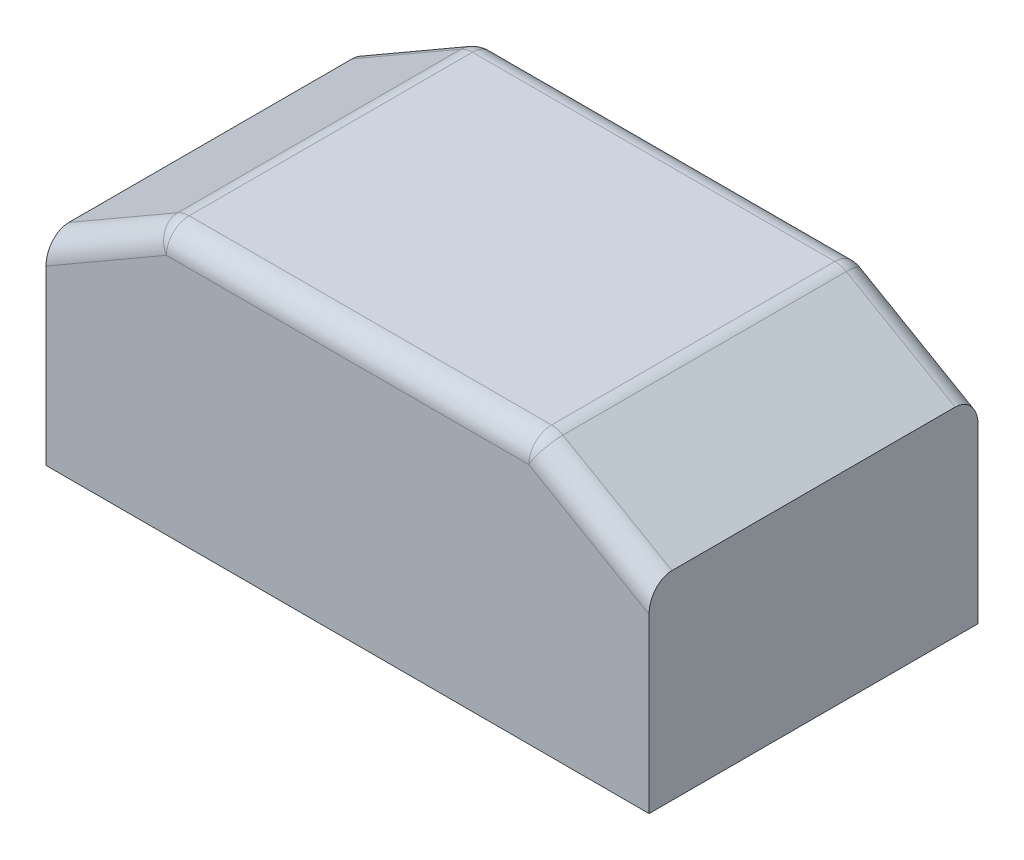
ISO-10303-21;
HEADER;
FILE_DESCRIPTION(('STEP AP214'),'2;1');
FILE_NAME('part.step','',(''),(''),'','','');
FILE_SCHEMA(('AUTOMOTIVE_DESIGN { 1 0 10303 214 1 1 1 1 }'));
ENDSEC;
DATA;
#1=APPLICATION_CONTEXT('core data for automotive mechanical design processes');
#2=APPLICATION_PROTOCOL_DEFINITION('international standard','automotive_design',2000,#1);
#3=PRODUCT_CONTEXT('',#1,'mechanical');
#4=PRODUCT('Part','Part','',(#3));
#5=PRODUCT_RELATED_PRODUCT_CATEGORY('part','',(#4));
#6=PRODUCT_DEFINITION_FORMATION('','',#4);
#7=PRODUCT_DEFINITION_CONTEXT('part definition',#1,'design');
#8=PRODUCT_DEFINITION('design','',#6,#7);
#9=PRODUCT_DEFINITION_SHAPE('','',#8);
#10=(LENGTH_UNIT() NAMED_UNIT(*) SI_UNIT(.MILLI.,.METRE.));
#11=(NAMED_UNIT(*) PLANE_ANGLE_UNIT() SI_UNIT($,.RADIAN.));
#12=(NAMED_UNIT(*) SI_UNIT($,.STERADIAN.) SOLID_ANGLE_UNIT());
#13=UNCERTAINTY_MEASURE_WITH_UNIT(LENGTH_MEASURE(1.E-05),#10,'distance_accuracy_value','');
#14=(GEOMETRIC_REPRESENTATION_CONTEXT(3) GLOBAL_UNCERTAINTY_ASSIGNED_CONTEXT((#13)) GLOBAL_UNIT_ASSIGNED_CONTEXT((#10,
#11,#12)) REPRESENTATION_CONTEXT('',''));
#15=CARTESIAN_POINT('',(0.,0.,0.));
#16=DIRECTION('',(0.,0.,1.));
#17=DIRECTION('',(1.,0.,0.));
#18=AXIS2_PLACEMENT_3D('',#15,#16,#17);
#19=CARTESIAN_POINT('',(0.,58.,0.));
#20=DIRECTION('',(1.,0.,0.));
#21=DIRECTION('',(0.,0.,-1.));
#22=AXIS2_PLACEMENT_3D('',#19,#20,#21);
#23=PLANE('',#22);
#24=DIRECTION('',(0.,0.,-1.));
#25=VECTOR('',#24,1.);
#26=CARTESIAN_POINT('',(0.,43.5662432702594,0.));
#27=LINE('',#26,#25);
#28=CARTESIAN_POINT('',(0.,43.5662432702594,-5.));
#29=VERTEX_POINT('',#28);
#30=CARTESIAN_POINT('',(0.,43.5662432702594,-67.));
#31=VERTEX_POINT('',#30);
#32=EDGE_CURVE('E129',#29,#31,#27,.T.);
#33=ORIENTED_EDGE('',*,*,#32,.T.);
#34=CARTESIAN_POINT('',(0.,37.7927405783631,-67.));
#35=DIRECTION('',(1.,0.,0.));
#36=DIRECTION('',(0.,1.,0.));
#37=AXIS2_PLACEMENT_3D('',#34,#35,#36);
#38=ELLIPSE('',#37,5.77350269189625,5.);
#39=CARTESIAN_POINT('',(0.,37.7927405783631,-72.));
#40=VERTEX_POINT('',#39);
#41=EDGE_CURVE('E184',#31,#40,#38,.F.);
#42=ORIENTED_EDGE('',*,*,#41,.T.);
#43=DIRECTION('',(0.,-1.,0.));
#44=VECTOR('',#43,1.);
#45=CARTESIAN_POINT('',(0.,58.,-72.));
#46=LINE('',#45,#44);
#47=CARTESIAN_POINT('',(0.,0.,-72.));
#48=VERTEX_POINT('',#47);
#49=EDGE_CURVE('E142',#40,#48,#46,.T.);
#50=ORIENTED_EDGE('',*,*,#49,.T.);
#51=DIRECTION('',(0.,0.,1.));
#52=VECTOR('',#51,1.);
#53=CARTESIAN_POINT('',(0.,0.,0.));
#54=LINE('',#53,#52);
#55=CARTESIAN_POINT('',(0.,0.,0.));
#56=VERTEX_POINT('',#55);
#57=EDGE_CURVE('E136',#48,#56,#54,.T.);
#58=ORIENTED_EDGE('',*,*,#57,.T.);
#59=DIRECTION('',(0.,-1.,0.));
#60=VECTOR('',#59,1.);
#61=CARTESIAN_POINT('',(0.,58.,0.));
#62=LINE('',#61,#60);
#63=CARTESIAN_POINT('',(0.,37.7927405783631,0.));
#64=VERTEX_POINT('',#63);
#65=EDGE_CURVE('E121',#64,#56,#62,.T.);
#66=ORIENTED_EDGE('',*,*,#65,.F.);
#67=CARTESIAN_POINT('',(0.,37.7927405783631,-5.));
#68=DIRECTION('',(1.,0.,0.));
#69=DIRECTION('',(0.,-1.,0.));
#70=AXIS2_PLACEMENT_3D('',#67,#68,#69);
#71=ELLIPSE('',#70,5.77350269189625,5.);
#72=EDGE_CURVE('E182',#64,#29,#71,.F.);
#73=ORIENTED_EDGE('',*,*,#72,.T.);
#74=EDGE_LOOP('',(#33,#42,#50,#58,#66,#73));
#75=FACE_BOUND('',#74,.T.);
#76=ADVANCED_FACE('F34',(#75),#23,.F.);
#77=CARTESIAN_POINT('',(0.,58.,0.));
#78=DIRECTION('',(0.,0.,-1.));
#79=DIRECTION('',(-1.,0.,0.));
#80=AXIS2_PLACEMENT_3D('',#77,#78,#79);
#81=PLANE('',#80);
#82=DIRECTION('',(0.,-1.,0.));
#83=VECTOR('',#82,1.);
#84=CARTESIAN_POINT('',(132.,58.,0.));
#85=LINE('',#84,#83);
#86=CARTESIAN_POINT('',(132.,37.7927405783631,0.));
#87=VERTEX_POINT('',#86);
#88=CARTESIAN_POINT('',(132.,0.,0.));
#89=VERTEX_POINT('',#88);
#90=EDGE_CURVE('E130',#87,#89,#85,.T.);
#91=ORIENTED_EDGE('',*,*,#90,.F.);
#92=DIRECTION('',(0.86602540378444,-0.499999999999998,0.));
#93=VECTOR('',#92,1.);
#94=CARTESIAN_POINT('',(104.5,53.6698729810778,0.));
#95=LINE('',#94,#93);
#96=CARTESIAN_POINT('',(105.660254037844,53.,0.));
#97=VERTEX_POINT('',#96);
#98=EDGE_CURVE('E11',#87,#97,#95,.F.);
#99=ORIENTED_EDGE('',*,*,#98,.T.);
#100=DIRECTION('',(1.,0.,0.));
#101=VECTOR('',#100,1.);
#102=CARTESIAN_POINT('',(0.,53.,0.));
#103=LINE('',#102,#101);
#104=CARTESIAN_POINT('',(26.3397459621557,53.,0.));
#105=VERTEX_POINT('',#104);
#106=EDGE_CURVE('E50',#97,#105,#103,.F.);
#107=ORIENTED_EDGE('',*,*,#106,.T.);
#108=DIRECTION('',(0.86602540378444,0.499999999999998,0.));
#109=VECTOR('',#108,1.);
#110=CARTESIAN_POINT('',(2.5,39.2361162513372,0.));
#111=LINE('',#110,#109);
#112=EDGE_CURVE('E43',#105,#64,#111,.F.);
#113=ORIENTED_EDGE('',*,*,#112,.T.);
#114=ORIENTED_EDGE('',*,*,#65,.T.);
#115=DIRECTION('',(1.,0.,0.));
#116=VECTOR('',#115,1.);
#117=CARTESIAN_POINT('',(0.,0.,0.));
#118=LINE('',#117,#116);
#119=EDGE_CURVE('E124',#56,#89,#118,.T.);
#120=ORIENTED_EDGE('',*,*,#119,.T.);
#121=EDGE_LOOP('',(#91,#99,#107,#113,#114,#120));
#122=FACE_BOUND('',#121,.T.);
#123=ADVANCED_FACE('F123',(#122),#81,.F.);
#124=CARTESIAN_POINT('',(132.,58.,0.));
#125=DIRECTION('',(-1.,0.,0.));
#126=DIRECTION('',(0.,0.,1.));
#127=AXIS2_PLACEMENT_3D('',#124,#125,#126);
#128=PLANE('',#127);
#129=DIRECTION('',(0.,-1.,0.));
#130=VECTOR('',#129,1.);
#131=CARTESIAN_POINT('',(132.,58.,-72.));
#132=LINE('',#131,#130);
#133=CARTESIAN_POINT('',(132.,37.7927405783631,-72.));
#134=VERTEX_POINT('',#133);
#135=CARTESIAN_POINT('',(132.,0.,-72.));
#136=VERTEX_POINT('',#135);
#137=EDGE_CURVE('E152',#134,#136,#132,.T.);
#138=ORIENTED_EDGE('',*,*,#137,.F.);
#139=CARTESIAN_POINT('',(132.,37.7927405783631,-67.));
#140=DIRECTION('',(-1.,0.,0.));
#141=DIRECTION('',(0.,-1.,0.));
#142=AXIS2_PLACEMENT_3D('',#139,#140,#141);
#143=ELLIPSE('',#142,5.77350269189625,5.);
#144=CARTESIAN_POINT('',(132.,43.5662432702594,-67.));
#145=VERTEX_POINT('',#144);
#146=EDGE_CURVE('E168',#134,#145,#143,.F.);
#147=ORIENTED_EDGE('',*,*,#146,.T.);
#148=DIRECTION('',(0.,0.,1.));
#149=VECTOR('',#148,1.);
#150=CARTESIAN_POINT('',(132.,43.5662432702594,0.));
#151=LINE('',#150,#149);
#152=CARTESIAN_POINT('',(132.,43.5662432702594,-5.));
#153=VERTEX_POINT('',#152);
#154=EDGE_CURVE('E156',#145,#153,#151,.T.);
#155=ORIENTED_EDGE('',*,*,#154,.T.);
#156=CARTESIAN_POINT('',(132.,37.7927405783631,-5.));
#157=DIRECTION('',(-1.,0.,0.));
#158=DIRECTION('',(0.,1.,0.));
#159=AXIS2_PLACEMENT_3D('',#156,#157,#158);
#160=ELLIPSE('',#159,5.77350269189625,5.);
#161=EDGE_CURVE('E166',#153,#87,#160,.F.);
#162=ORIENTED_EDGE('',*,*,#161,.T.);
#163=ORIENTED_EDGE('',*,*,#90,.T.);
#164=DIRECTION('',(0.,0.,-1.));
#165=VECTOR('',#164,1.);
#166=CARTESIAN_POINT('',(132.,0.,0.));
#167=LINE('',#166,#165);
#168=EDGE_CURVE('E138',#89,#136,#167,.T.);
#169=ORIENTED_EDGE('',*,*,#168,.T.);
#170=EDGE_LOOP('',(#138,#147,#155,#162,#163,#169));
#171=FACE_BOUND('',#170,.T.);
#172=ADVANCED_FACE('F266',(#171),#128,.F.);
#173=CARTESIAN_POINT('',(0.,58.,-72.));
#174=DIRECTION('',(0.,0.,1.));
#175=DIRECTION('',(1.,0.,0.));
#176=AXIS2_PLACEMENT_3D('',#173,#174,#175);
#177=PLANE('',#176);
#178=DIRECTION('',(-1.,0.,0.));
#179=VECTOR('',#178,1.);
#180=CARTESIAN_POINT('',(0.,53.,-72.));
#181=LINE('',#180,#179);
#182=CARTESIAN_POINT('',(26.3397459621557,53.,-72.));
#183=VERTEX_POINT('',#182);
#184=CARTESIAN_POINT('',(105.660254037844,53.,-72.));
#185=VERTEX_POINT('',#184);
#186=EDGE_CURVE('E159',#183,#185,#181,.F.);
#187=ORIENTED_EDGE('',*,*,#186,.T.);
#188=DIRECTION('',(-0.86602540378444,0.499999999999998,0.));
#189=VECTOR('',#188,1.);
#190=CARTESIAN_POINT('',(129.5,39.2361162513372,-72.));
#191=LINE('',#190,#189);
#192=EDGE_CURVE('E163',#185,#134,#191,.F.);
#193=ORIENTED_EDGE('',*,*,#192,.T.);
#194=ORIENTED_EDGE('',*,*,#137,.T.);
#195=DIRECTION('',(-1.,0.,0.));
#196=VECTOR('',#195,1.);
#197=CARTESIAN_POINT('',(0.,0.,-72.));
#198=LINE('',#197,#196);
#199=EDGE_CURVE('E149',#136,#48,#198,.T.);
#200=ORIENTED_EDGE('',*,*,#199,.T.);
#201=ORIENTED_EDGE('',*,*,#49,.F.);
#202=DIRECTION('',(-0.86602540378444,-0.499999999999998,0.));
#203=VECTOR('',#202,1.);
#204=CARTESIAN_POINT('',(27.5000000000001,53.6698729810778,-72.));
#205=LINE('',#204,#203);
#206=EDGE_CURVE('E161',#40,#183,#205,.F.);
#207=ORIENTED_EDGE('',*,*,#206,.T.);
#208=EDGE_LOOP('',(#187,#193,#194,#200,#201,#207));
#209=FACE_BOUND('',#208,.T.);
#210=ADVANCED_FACE('F262',(#209),#177,.F.);
#211=CARTESIAN_POINT('',(0.,58.,0.));
#212=DIRECTION('',(0.,-1.,0.));
#213=DIRECTION('',(0.,0.,-1.));
#214=AXIS2_PLACEMENT_3D('',#211,#212,#213);
#215=PLANE('',#214);
#216=DIRECTION('',(1.,0.,0.));
#217=VECTOR('',#216,1.);
#218=CARTESIAN_POINT('',(0.,58.,-5.));
#219=LINE('',#218,#217);
#220=CARTESIAN_POINT('',(26.3397459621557,58.,-5.));
#221=VERTEX_POINT('',#220);
#222=CARTESIAN_POINT('',(105.660254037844,58.,-5.));
#223=VERTEX_POINT('',#222);
#224=EDGE_CURVE('E188',#221,#223,#219,.T.);
#225=ORIENTED_EDGE('',*,*,#224,.T.);
#226=DIRECTION('',(0.,0.,1.));
#227=VECTOR('',#226,1.);
#228=CARTESIAN_POINT('',(105.660254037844,58.,-72.));
#229=LINE('',#228,#227);
#230=CARTESIAN_POINT('',(105.660254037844,58.,-67.));
#231=VERTEX_POINT('',#230);
#232=EDGE_CURVE('E193',#223,#231,#229,.F.);
#233=ORIENTED_EDGE('',*,*,#232,.T.);
#234=DIRECTION('',(-1.,0.,0.));
#235=VECTOR('',#234,1.);
#236=CARTESIAN_POINT('',(0.,58.,-67.));
#237=LINE('',#236,#235);
#238=CARTESIAN_POINT('',(26.3397459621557,58.,-67.));
#239=VERTEX_POINT('',#238);
#240=EDGE_CURVE('E190',#231,#239,#237,.T.);
#241=ORIENTED_EDGE('',*,*,#240,.T.);
#242=DIRECTION('',(0.,0.,-1.));
#243=VECTOR('',#242,1.);
#244=CARTESIAN_POINT('',(26.3397459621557,58.,0.));
#245=LINE('',#244,#243);
#246=EDGE_CURVE('E186',#239,#221,#245,.F.);
#247=ORIENTED_EDGE('',*,*,#246,.T.);
#248=EDGE_LOOP('',(#225,#233,#241,#247));
#249=FACE_BOUND('',#248,.T.);
#250=ADVANCED_FACE('F280',(#249),#215,.F.);
#251=CARTESIAN_POINT('',(0.,0.,0.));
#252=DIRECTION('',(0.,-1.,0.));
#253=DIRECTION('',(0.,0.,-1.));
#254=AXIS2_PLACEMENT_3D('',#251,#252,#253);
#255=PLANE('',#254);
#256=ORIENTED_EDGE('',*,*,#57,.F.);
#257=ORIENTED_EDGE('',*,*,#199,.F.);
#258=ORIENTED_EDGE('',*,*,#168,.F.);
#259=ORIENTED_EDGE('',*,*,#119,.F.);
#260=EDGE_LOOP('',(#256,#257,#258,#259));
#261=FACE_BOUND('',#260,.T.);
#262=ADVANCED_FACE('F134',(#261),#255,.T.);
#263=CARTESIAN_POINT('',(25.0000000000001,58.,0.));
#264=DIRECTION('',(0.499999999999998,-0.866025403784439,0.));
#265=DIRECTION('',(0.,0.,1.));
#266=AXIS2_PLACEMENT_3D('',#263,#264,#265);
#267=PLANE('',#266);
#268=DIRECTION('',(0.,0.,1.));
#269=VECTOR('',#268,1.);
#270=CARTESIAN_POINT('',(23.8397459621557,57.3301270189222,-72.));
#271=LINE('',#270,#269);
#272=CARTESIAN_POINT('',(23.8397459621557,57.3301270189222,-5.));
#273=VERTEX_POINT('',#272);
#274=CARTESIAN_POINT('',(23.8397459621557,57.3301270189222,-67.));
#275=VERTEX_POINT('',#274);
#276=EDGE_CURVE('E176',#273,#275,#271,.F.);
#277=ORIENTED_EDGE('',*,*,#276,.T.);
#278=DIRECTION('',(0.86602540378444,0.499999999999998,0.));
#279=VECTOR('',#278,1.);
#280=CARTESIAN_POINT('',(0.,43.5662432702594,-67.));
#281=LINE('',#280,#279);
#282=EDGE_CURVE('E180',#275,#31,#281,.F.);
#283=ORIENTED_EDGE('',*,*,#282,.T.);
#284=ORIENTED_EDGE('',*,*,#32,.F.);
#285=DIRECTION('',(-0.86602540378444,-0.499999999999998,0.));
#286=VECTOR('',#285,1.);
#287=CARTESIAN_POINT('',(25.0000000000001,58.,-5.));
#288=LINE('',#287,#286);
#289=EDGE_CURVE('E178',#29,#273,#288,.F.);
#290=ORIENTED_EDGE('',*,*,#289,.T.);
#291=EDGE_LOOP('',(#277,#283,#284,#290));
#292=FACE_BOUND('',#291,.T.);
#293=ADVANCED_FACE('F242',(#292),#267,.F.);
#294=CARTESIAN_POINT('',(107.,58.,0.));
#295=DIRECTION('',(-0.499999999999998,-0.86602540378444,0.));
#296=DIRECTION('',(0.,0.,-1.));
#297=AXIS2_PLACEMENT_3D('',#294,#295,#296);
#298=PLANE('',#297);
#299=ORIENTED_EDGE('',*,*,#154,.F.);
#300=DIRECTION('',(0.86602540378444,-0.499999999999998,0.));
#301=VECTOR('',#300,1.);
#302=CARTESIAN_POINT('',(107.,58.,-67.));
#303=LINE('',#302,#301);
#304=CARTESIAN_POINT('',(108.160254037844,57.3301270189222,-67.));
#305=VERTEX_POINT('',#304);
#306=EDGE_CURVE('E174',#145,#305,#303,.F.);
#307=ORIENTED_EDGE('',*,*,#306,.T.);
#308=DIRECTION('',(0.,0.,-1.));
#309=VECTOR('',#308,1.);
#310=CARTESIAN_POINT('',(108.160254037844,57.3301270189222,0.));
#311=LINE('',#310,#309);
#312=CARTESIAN_POINT('',(108.160254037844,57.3301270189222,-5.));
#313=VERTEX_POINT('',#312);
#314=EDGE_CURVE('E170',#305,#313,#311,.F.);
#315=ORIENTED_EDGE('',*,*,#314,.T.);
#316=DIRECTION('',(-0.86602540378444,0.499999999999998,0.));
#317=VECTOR('',#316,1.);
#318=CARTESIAN_POINT('',(132.,43.5662432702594,-5.));
#319=LINE('',#318,#317);
#320=EDGE_CURVE('E172',#313,#153,#319,.F.);
#321=ORIENTED_EDGE('',*,*,#320,.T.);
#322=EDGE_LOOP('',(#299,#307,#315,#321));
#323=FACE_BOUND('',#322,.T.);
#324=ADVANCED_FACE('F299',(#323),#298,.F.);
#325=CARTESIAN_POINT('',(8.74999999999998,42.8445554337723,-5.));
#326=DIRECTION('',(-0.86602540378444,-0.499999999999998,0.));
#327=DIRECTION('',(0.499999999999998,-0.866025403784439,0.));
#328=AXIS2_PLACEMENT_3D('',#325,#326,#327);
#329=CYLINDRICAL_SURFACE('',#328,5.);
#330=CARTESIAN_POINT('',(26.3397459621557,53.,-5.));
#331=DIRECTION('',(0.86602540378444,0.499999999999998,0.));
#332=DIRECTION('',(-0.499999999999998,0.86602540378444,0.));
#333=AXIS2_PLACEMENT_3D('',#330,#331,#332);
#334=CIRCLE('',#333,5.);
#335=EDGE_CURVE('E38',#273,#105,#334,.T.);
#336=ORIENTED_EDGE('',*,*,#335,.F.);
#337=ORIENTED_EDGE('',*,*,#289,.F.);
#338=ORIENTED_EDGE('',*,*,#72,.F.);
#339=ORIENTED_EDGE('',*,*,#112,.F.);
#340=EDGE_LOOP('',(#336,#337,#338,#339));
#341=FACE_BOUND('',#340,.T.);
#342=ADVANCED_FACE('F36',(#341),#329,.T.);
#343=CARTESIAN_POINT('',(26.3397459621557,53.,-5.));
#344=DIRECTION('',(0.,0.,1.));
#345=DIRECTION('',(1.,0.,0.));
#346=AXIS2_PLACEMENT_3D('',#343,#344,#345);
#347=SPHERICAL_SURFACE('',#346,5.);
#348=CARTESIAN_POINT('',(26.3397459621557,53.,-5.));
#349=DIRECTION('',(0.,0.,1.));
#350=DIRECTION('',(1.,0.,0.));
#351=AXIS2_PLACEMENT_3D('',#348,#349,#350);
#352=CIRCLE('',#351,5.);
#353=EDGE_CURVE('E223',#273,#221,#352,.F.);
#354=ORIENTED_EDGE('',*,*,#353,.F.);
#355=ORIENTED_EDGE('',*,*,#335,.T.);
#356=CARTESIAN_POINT('',(26.3397459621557,53.,-5.));
#357=DIRECTION('',(-1.,0.,0.));
#358=DIRECTION('',(0.,-1.,0.));
#359=AXIS2_PLACEMENT_3D('',#356,#357,#358);
#360=CIRCLE('',#359,5.);
#361=EDGE_CURVE('E146',#221,#105,#360,.F.);
#362=ORIENTED_EDGE('',*,*,#361,.F.);
#363=EDGE_LOOP('',(#354,#355,#362));
#364=FACE_BOUND('',#363,.T.);
#365=ADVANCED_FACE('F234',(#364),#347,.T.);
#366=CARTESIAN_POINT('',(24.2499999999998,100.002232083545,-5.));
#367=DIRECTION('',(-0.86602540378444,0.499999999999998,0.));
#368=DIRECTION('',(-0.499999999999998,-0.86602540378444,0.));
#369=AXIS2_PLACEMENT_3D('',#366,#367,#368);
#370=CYLINDRICAL_SURFACE('',#369,5.);
#371=ORIENTED_EDGE('',*,*,#161,.F.);
#372=ORIENTED_EDGE('',*,*,#320,.F.);
#373=CARTESIAN_POINT('',(105.660254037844,53.,-5.));
#374=DIRECTION('',(-0.866025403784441,0.499999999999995,0.));
#375=DIRECTION('',(-0.499999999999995,-0.866025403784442,0.));
#376=AXIS2_PLACEMENT_3D('',#373,#374,#375);
#377=CIRCLE('',#376,5.);
#378=EDGE_CURVE('E220',#97,#313,#377,.T.);
#379=ORIENTED_EDGE('',*,*,#378,.F.);
#380=ORIENTED_EDGE('',*,*,#98,.F.);
#381=EDGE_LOOP('',(#371,#372,#379,#380));
#382=FACE_BOUND('',#381,.T.);
#383=ADVANCED_FACE('F269',(#382),#370,.T.);
#384=CARTESIAN_POINT('',(0.,53.,-5.));
#385=DIRECTION('',(1.,0.,0.));
#386=DIRECTION('',(0.,0.,-1.));
#387=AXIS2_PLACEMENT_3D('',#384,#385,#386);
#388=CYLINDRICAL_SURFACE('',#387,5.);
#389=ORIENTED_EDGE('',*,*,#361,.T.);
#390=ORIENTED_EDGE('',*,*,#106,.F.);
#391=CARTESIAN_POINT('',(105.660254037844,53.,-5.));
#392=DIRECTION('',(1.,0.,0.));
#393=DIRECTION('',(0.,0.,-1.));
#394=AXIS2_PLACEMENT_3D('',#391,#392,#393);
#395=CIRCLE('',#394,5.);
#396=EDGE_CURVE('E217',#223,#97,#395,.T.);
#397=ORIENTED_EDGE('',*,*,#396,.F.);
#398=ORIENTED_EDGE('',*,*,#224,.F.);
#399=EDGE_LOOP('',(#389,#390,#397,#398));
#400=FACE_BOUND('',#399,.T.);
#401=ADVANCED_FACE('F229',(#400),#388,.T.);
#402=CARTESIAN_POINT('',(26.3397459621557,53.,0.));
#403=DIRECTION('',(0.,0.,1.));
#404=DIRECTION('',(1.,0.,0.));
#405=AXIS2_PLACEMENT_3D('',#402,#403,#404);
#406=CYLINDRICAL_SURFACE('',#405,5.);
#407=ORIENTED_EDGE('',*,*,#353,.T.);
#408=ORIENTED_EDGE('',*,*,#246,.F.);
#409=CARTESIAN_POINT('',(26.3397459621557,53.,-67.));
#410=DIRECTION('',(0.,0.,-1.));
#411=DIRECTION('',(-1.,0.,0.));
#412=AXIS2_PLACEMENT_3D('',#409,#410,#411);
#413=CIRCLE('',#412,5.);
#414=EDGE_CURVE('E214',#275,#239,#413,.T.);
#415=ORIENTED_EDGE('',*,*,#414,.F.);
#416=ORIENTED_EDGE('',*,*,#276,.F.);
#417=EDGE_LOOP('',(#407,#408,#415,#416));
#418=FACE_BOUND('',#417,.T.);
#419=ADVANCED_FACE('F252',(#418),#406,.T.);
#420=CARTESIAN_POINT('',(8.74999999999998,42.8445554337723,-67.));
#421=DIRECTION('',(0.86602540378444,0.499999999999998,0.));
#422=DIRECTION('',(-0.499999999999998,0.866025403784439,0.));
#423=AXIS2_PLACEMENT_3D('',#420,#421,#422);
#424=CYLINDRICAL_SURFACE('',#423,5.);
#425=ORIENTED_EDGE('',*,*,#41,.F.);
#426=ORIENTED_EDGE('',*,*,#282,.F.);
#427=CARTESIAN_POINT('',(26.3397459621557,53.,-67.));
#428=DIRECTION('',(0.86602540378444,0.499999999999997,0.));
#429=DIRECTION('',(-0.499999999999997,0.86602540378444,0.));
#430=AXIS2_PLACEMENT_3D('',#427,#428,#429);
#431=CIRCLE('',#430,5.);
#432=EDGE_CURVE('E211',#183,#275,#431,.T.);
#433=ORIENTED_EDGE('',*,*,#432,.F.);
#434=ORIENTED_EDGE('',*,*,#206,.F.);
#435=EDGE_LOOP('',(#425,#426,#433,#434));
#436=FACE_BOUND('',#435,.T.);
#437=ADVANCED_FACE('F247',(#436),#424,.T.);
#438=CARTESIAN_POINT('',(105.660254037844,53.,-5.));
#439=DIRECTION('',(0.,0.,1.));
#440=DIRECTION('',(1.,0.,0.));
#441=AXIS2_PLACEMENT_3D('',#438,#439,#440);
#442=SPHERICAL_SURFACE('',#441,5.);
#443=ORIENTED_EDGE('',*,*,#396,.T.);
#444=ORIENTED_EDGE('',*,*,#378,.T.);
#445=CARTESIAN_POINT('',(105.660254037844,53.,-5.));
#446=DIRECTION('',(0.,0.,1.));
#447=DIRECTION('',(1.,0.,0.));
#448=AXIS2_PLACEMENT_3D('',#445,#446,#447);
#449=CIRCLE('',#448,5.);
#450=EDGE_CURVE('E208',#223,#313,#449,.F.);
#451=ORIENTED_EDGE('',*,*,#450,.F.);
#452=EDGE_LOOP('',(#443,#444,#451));
#453=FACE_BOUND('',#452,.T.);
#454=ADVANCED_FACE('F273',(#453),#442,.T.);
#455=CARTESIAN_POINT('',(26.3397459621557,53.,-67.));
#456=DIRECTION('',(0.,0.,1.));
#457=DIRECTION('',(1.,0.,0.));
#458=AXIS2_PLACEMENT_3D('',#455,#456,#457);
#459=SPHERICAL_SURFACE('',#458,5.);
#460=ORIENTED_EDGE('',*,*,#432,.T.);
#461=ORIENTED_EDGE('',*,*,#414,.T.);
#462=CARTESIAN_POINT('',(26.3397459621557,53.,-67.));
#463=DIRECTION('',(-1.,0.,0.));
#464=DIRECTION('',(0.,0.,1.));
#465=AXIS2_PLACEMENT_3D('',#462,#463,#464);
#466=CIRCLE('',#465,5.);
#467=EDGE_CURVE('E206',#183,#239,#466,.F.);
#468=ORIENTED_EDGE('',*,*,#467,.F.);
#469=EDGE_LOOP('',(#460,#461,#468));
#470=FACE_BOUND('',#469,.T.);
#471=ADVANCED_FACE('F254',(#470),#459,.T.);
#472=CARTESIAN_POINT('',(105.660254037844,53.,0.));
#473=DIRECTION('',(0.,0.,-1.));
#474=DIRECTION('',(-1.,0.,0.));
#475=AXIS2_PLACEMENT_3D('',#472,#473,#474);
#476=CYLINDRICAL_SURFACE('',#475,5.);
#477=ORIENTED_EDGE('',*,*,#450,.T.);
#478=ORIENTED_EDGE('',*,*,#314,.F.);
#479=CARTESIAN_POINT('',(105.660254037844,53.,-67.));
#480=DIRECTION('',(0.,0.,-1.));
#481=DIRECTION('',(-1.,0.,0.));
#482=AXIS2_PLACEMENT_3D('',#479,#480,#481);
#483=CIRCLE('',#482,5.);
#484=EDGE_CURVE('E203',#231,#305,#483,.T.);
#485=ORIENTED_EDGE('',*,*,#484,.F.);
#486=ORIENTED_EDGE('',*,*,#232,.F.);
#487=EDGE_LOOP('',(#477,#478,#485,#486));
#488=FACE_BOUND('',#487,.T.);
#489=ADVANCED_FACE('F278',(#488),#476,.T.);
#490=CARTESIAN_POINT('',(0.,53.,-67.));
#491=DIRECTION('',(-1.,0.,0.));
#492=DIRECTION('',(0.,0.,1.));
#493=AXIS2_PLACEMENT_3D('',#490,#491,#492);
#494=CYLINDRICAL_SURFACE('',#493,5.);
#495=ORIENTED_EDGE('',*,*,#467,.T.);
#496=ORIENTED_EDGE('',*,*,#240,.F.);
#497=CARTESIAN_POINT('',(105.660254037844,53.,-67.));
#498=DIRECTION('',(1.,0.,0.));
#499=DIRECTION('',(0.,1.,0.));
#500=AXIS2_PLACEMENT_3D('',#497,#498,#499);
#501=CIRCLE('',#500,5.);
#502=EDGE_CURVE('E200',#185,#231,#501,.T.);
#503=ORIENTED_EDGE('',*,*,#502,.F.);
#504=ORIENTED_EDGE('',*,*,#186,.F.);
#505=EDGE_LOOP('',(#495,#496,#503,#504));
#506=FACE_BOUND('',#505,.T.);
#507=ADVANCED_FACE('F259',(#506),#494,.T.);
#508=CARTESIAN_POINT('',(105.660254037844,53.,-67.));
#509=DIRECTION('',(0.,0.,1.));
#510=DIRECTION('',(1.,0.,0.));
#511=AXIS2_PLACEMENT_3D('',#508,#509,#510);
#512=SPHERICAL_SURFACE('',#511,5.);
#513=ORIENTED_EDGE('',*,*,#502,.T.);
#514=ORIENTED_EDGE('',*,*,#484,.T.);
#515=CARTESIAN_POINT('',(105.660254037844,53.,-67.));
#516=DIRECTION('',(-0.86602540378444,0.499999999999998,0.));
#517=DIRECTION('',(-0.499999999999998,-0.86602540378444,0.));
#518=AXIS2_PLACEMENT_3D('',#515,#516,#517);
#519=CIRCLE('',#518,5.);
#520=EDGE_CURVE('E197',#185,#305,#519,.F.);
#521=ORIENTED_EDGE('',*,*,#520,.F.);
#522=EDGE_LOOP('',(#513,#514,#521));
#523=FACE_BOUND('',#522,.T.);
#524=ADVANCED_FACE('F306',(#523),#512,.T.);
#525=CARTESIAN_POINT('',(24.2499999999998,100.002232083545,-67.));
#526=DIRECTION('',(0.86602540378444,-0.499999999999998,0.));
#527=DIRECTION('',(0.499999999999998,0.86602540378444,0.));
#528=AXIS2_PLACEMENT_3D('',#525,#526,#527);
#529=CYLINDRICAL_SURFACE('',#528,5.);
#530=ORIENTED_EDGE('',*,*,#520,.T.);
#531=ORIENTED_EDGE('',*,*,#306,.F.);
#532=ORIENTED_EDGE('',*,*,#146,.F.);
#533=ORIENTED_EDGE('',*,*,#192,.F.);
#534=EDGE_LOOP('',(#530,#531,#532,#533));
#535=FACE_BOUND('',#534,.T.);
#536=ADVANCED_FACE('F303',(#535),#529,.T.);
#537=CLOSED_SHELL('',(#76,#123,#172,#210,#250,#262,#293,#324,#342,#365,#383,#401,#419,#437,#454,
#471,#489,#507,#524,#536));
#538=MANIFOLD_SOLID_BREP('B2',#537);
#539=ADVANCED_BREP_SHAPE_REPRESENTATION('',(#18,#538),#14);
#540=SHAPE_DEFINITION_REPRESENTATION(#9,#539);
ENDSEC;
END-ISO-10303-21;
